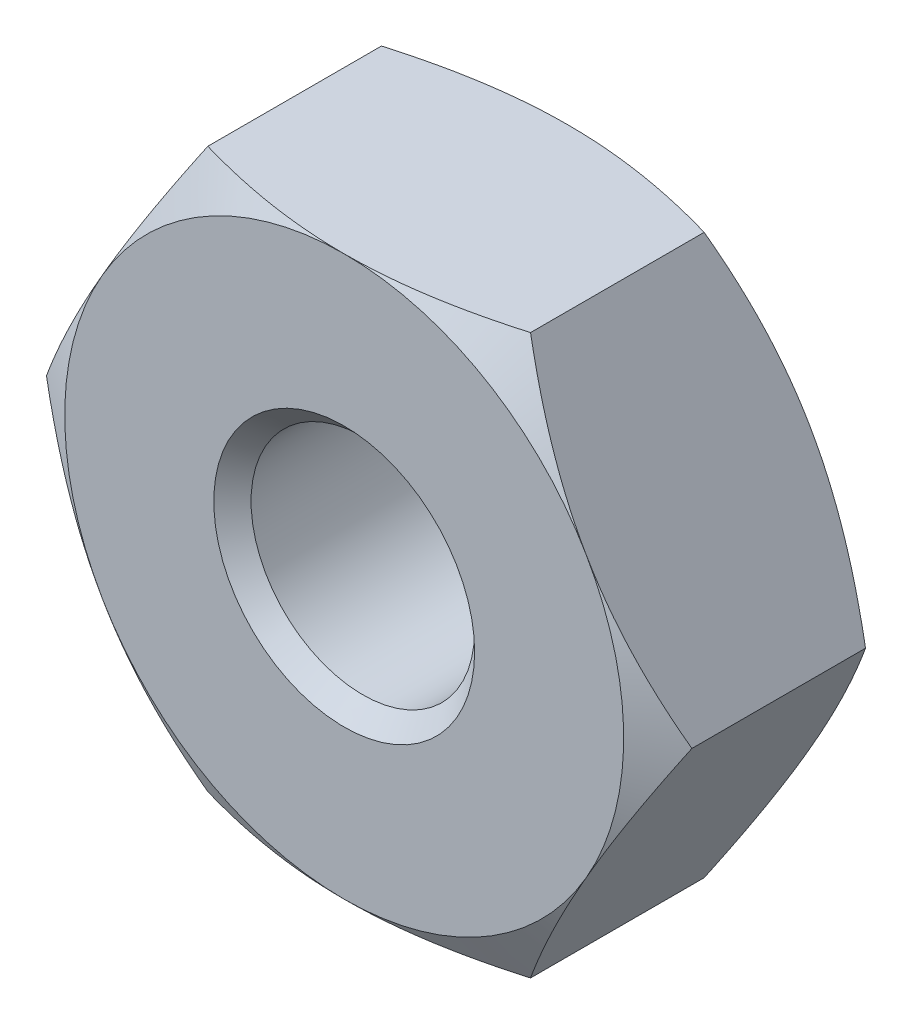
from build123d import *

# Parameters (mm, degrees)
SKETCH1_R     = 0.6
BASENUT_DEPTH = 1.2


with BuildPart() as part:
    # Sketch1 → BaseNut (new body)
    with BuildSketch(Plane.XY):
        Polygon((0.866025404, -1.5), (1.732050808, 0), (0.866025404, 1.5), (-0.866025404, 1.5), (-1.732050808, 0), (-0.866025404, -1.5), align=None)
        Circle(SKETCH1_R, mode=Mode.SUBTRACT)
    extrude(amount=-BASENUT_DEPTH)

    # Sketch2 → Double-Chamfer (revolve, cut)
    with BuildSketch(Plane(origin=(0.041740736, 0, -0.055654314), x_dir=(0, 0, 1), z_dir=(0, 1, 0))):
        Polygon((-1.144345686, 1.458259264), (-1.010371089, 1.690310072), (-1.144345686, 1.690310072), align=None)
        Polygon((0.055654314, 1.690310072), (0.055654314, 1.458259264), (-0.078320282, 1.690310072), align=None)
        Polygon((-1.044345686, 0.558259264), (-1.144345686, 0.658259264), (-1.144345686, 0.558259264), align=None)
        Polygon((0.055654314, 0.558259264), (-0.044345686, 0.558259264), (0.055654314, 0.658259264), align=None)
    revolve(axis=Axis((0, 0, 0.841771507), (0, 0, -1)), mode=Mode.SUBTRACT)


solid = part.part
